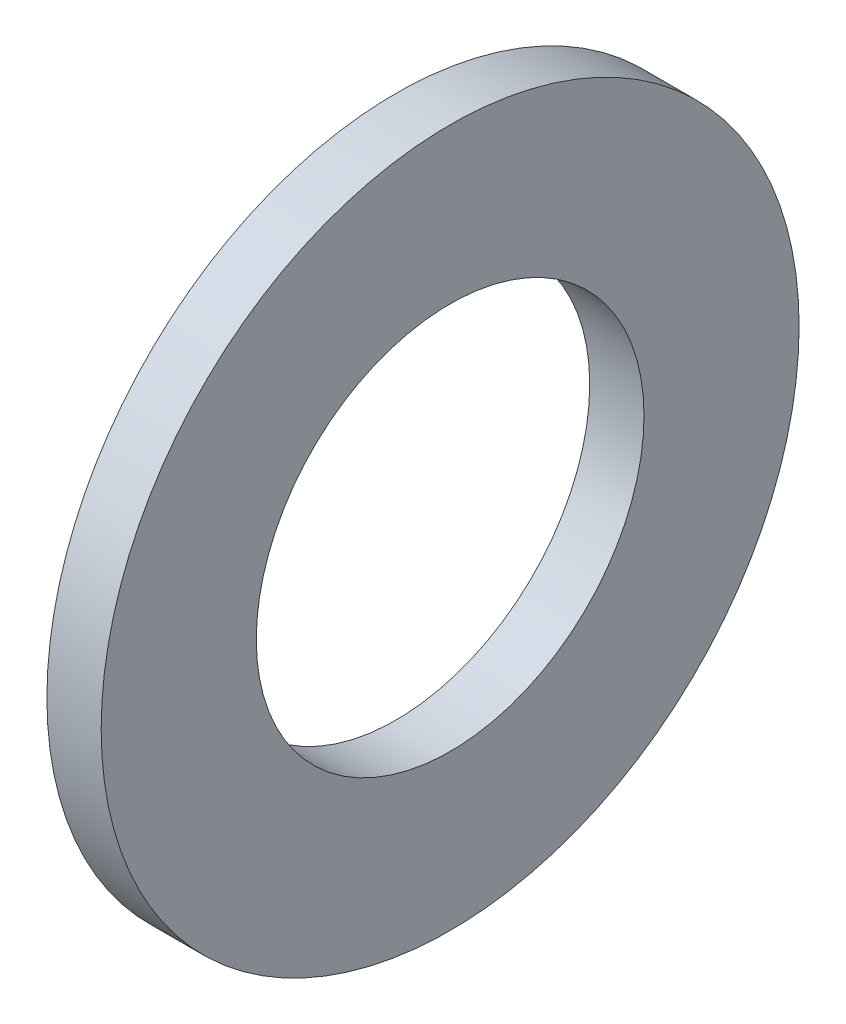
ISO-10303-21;
HEADER;
FILE_DESCRIPTION(('STEP AP214'),'2;1');
FILE_NAME('part.step','',(''),(''),'','','');
FILE_SCHEMA(('AUTOMOTIVE_DESIGN { 1 0 10303 214 1 1 1 1 }'));
ENDSEC;
DATA;
#1=APPLICATION_CONTEXT('core data for automotive mechanical design processes');
#2=APPLICATION_PROTOCOL_DEFINITION('international standard','automotive_design',2000,#1);
#3=PRODUCT_CONTEXT('',#1,'mechanical');
#4=PRODUCT('Part','Part','',(#3));
#5=PRODUCT_RELATED_PRODUCT_CATEGORY('part','',(#4));
#6=PRODUCT_DEFINITION_FORMATION('','',#4);
#7=PRODUCT_DEFINITION_CONTEXT('part definition',#1,'design');
#8=PRODUCT_DEFINITION('design','',#6,#7);
#9=PRODUCT_DEFINITION_SHAPE('','',#8);
#10=(LENGTH_UNIT() NAMED_UNIT(*) SI_UNIT(.MILLI.,.METRE.));
#11=(NAMED_UNIT(*) PLANE_ANGLE_UNIT() SI_UNIT($,.RADIAN.));
#12=(NAMED_UNIT(*) SI_UNIT($,.STERADIAN.) SOLID_ANGLE_UNIT());
#13=UNCERTAINTY_MEASURE_WITH_UNIT(LENGTH_MEASURE(1.E-05),#10,'distance_accuracy_value','');
#14=(GEOMETRIC_REPRESENTATION_CONTEXT(3) GLOBAL_UNCERTAINTY_ASSIGNED_CONTEXT((#13)) GLOBAL_UNIT_ASSIGNED_CONTEXT((#10,
#11,#12)) REPRESENTATION_CONTEXT('',''));
#15=CARTESIAN_POINT('',(0.,0.,0.));
#16=DIRECTION('',(0.,0.,1.));
#17=DIRECTION('',(1.,0.,0.));
#18=AXIS2_PLACEMENT_3D('',#15,#16,#17);
#19=CARTESIAN_POINT('',(1.4,0.,0.));
#20=DIRECTION('',(1.,0.,0.));
#21=DIRECTION('',(0.,0.,-1.));
#22=AXIS2_PLACEMENT_3D('',#19,#20,#21);
#23=PLANE('',#22);
#24=CARTESIAN_POINT('',(1.4,0.,0.));
#25=DIRECTION('',(1.,0.,0.));
#26=DIRECTION('',(0.,0.,-1.));
#27=AXIS2_PLACEMENT_3D('',#24,#25,#26);
#28=CIRCLE('',#27,5.);
#29=CARTESIAN_POINT('',(1.4,0.,-5.));
#30=VERTEX_POINT('',#29);
#31=EDGE_CURVE('E27',#30,#30,#28,.F.);
#32=ORIENTED_EDGE('',*,*,#31,.T.);
#33=EDGE_LOOP('',(#32));
#34=FACE_BOUND('',#33,.T.);
#35=CARTESIAN_POINT('',(1.4,0.,0.));
#36=DIRECTION('',(1.,0.,0.));
#37=DIRECTION('',(0.,0.,-1.));
#38=AXIS2_PLACEMENT_3D('',#35,#36,#37);
#39=CIRCLE('',#38,9.);
#40=CARTESIAN_POINT('',(1.4,0.,-9.));
#41=VERTEX_POINT('',#40);
#42=EDGE_CURVE('E18',#41,#41,#39,.F.);
#43=ORIENTED_EDGE('',*,*,#42,.F.);
#44=EDGE_LOOP('',(#43));
#45=FACE_BOUND('',#44,.T.);
#46=ADVANCED_FACE('F15',(#34,#45),#23,.T.);
#47=CARTESIAN_POINT('',(0.,0.,0.));
#48=DIRECTION('',(1.,0.,0.));
#49=DIRECTION('',(0.,0.,-1.));
#50=AXIS2_PLACEMENT_3D('',#47,#48,#49);
#51=CYLINDRICAL_SURFACE('',#50,9.);
#52=ORIENTED_EDGE('',*,*,#42,.T.);
#53=EDGE_LOOP('',(#52));
#54=FACE_BOUND('',#53,.T.);
#55=CARTESIAN_POINT('',(0.,0.,0.));
#56=DIRECTION('',(1.,0.,0.));
#57=DIRECTION('',(0.,0.,-1.));
#58=AXIS2_PLACEMENT_3D('',#55,#56,#57);
#59=CIRCLE('',#58,9.);
#60=CARTESIAN_POINT('',(0.,0.,-9.));
#61=VERTEX_POINT('',#60);
#62=EDGE_CURVE('E22',#61,#61,#59,.T.);
#63=ORIENTED_EDGE('',*,*,#62,.T.);
#64=EDGE_LOOP('',(#63));
#65=FACE_BOUND('',#64,.T.);
#66=ADVANCED_FACE('F35',(#54,#65),#51,.T.);
#67=CARTESIAN_POINT('',(0.,0.,0.));
#68=DIRECTION('',(1.,0.,0.));
#69=DIRECTION('',(0.,0.,-1.));
#70=AXIS2_PLACEMENT_3D('',#67,#68,#69);
#71=CYLINDRICAL_SURFACE('',#70,5.);
#72=ORIENTED_EDGE('',*,*,#31,.F.);
#73=EDGE_LOOP('',(#72));
#74=FACE_BOUND('',#73,.T.);
#75=CARTESIAN_POINT('',(0.,0.,0.));
#76=DIRECTION('',(1.,0.,0.));
#77=DIRECTION('',(0.,0.,-1.));
#78=AXIS2_PLACEMENT_3D('',#75,#76,#77);
#79=CIRCLE('',#78,5.);
#80=CARTESIAN_POINT('',(0.,0.,-5.));
#81=VERTEX_POINT('',#80);
#82=EDGE_CURVE('E10',#81,#81,#79,.F.);
#83=ORIENTED_EDGE('',*,*,#82,.T.);
#84=EDGE_LOOP('',(#83));
#85=FACE_BOUND('',#84,.T.);
#86=ADVANCED_FACE('F43',(#74,#85),#71,.F.);
#87=CARTESIAN_POINT('',(0.,0.,0.));
#88=DIRECTION('',(1.,0.,0.));
#89=DIRECTION('',(0.,0.,-1.));
#90=AXIS2_PLACEMENT_3D('',#87,#88,#89);
#91=PLANE('',#90);
#92=ORIENTED_EDGE('',*,*,#82,.F.);
#93=EDGE_LOOP('',(#92));
#94=FACE_BOUND('',#93,.T.);
#95=ORIENTED_EDGE('',*,*,#62,.F.);
#96=EDGE_LOOP('',(#95));
#97=FACE_BOUND('',#96,.T.);
#98=ADVANCED_FACE('F44',(#94,#97),#91,.F.);
#99=CLOSED_SHELL('',(#46,#66,#86,#98));
#100=MANIFOLD_SOLID_BREP('B1',#99);
#101=ADVANCED_BREP_SHAPE_REPRESENTATION('',(#18,#100),#14);
#102=SHAPE_DEFINITION_REPRESENTATION(#9,#101);
ENDSEC;
END-ISO-10303-21;
